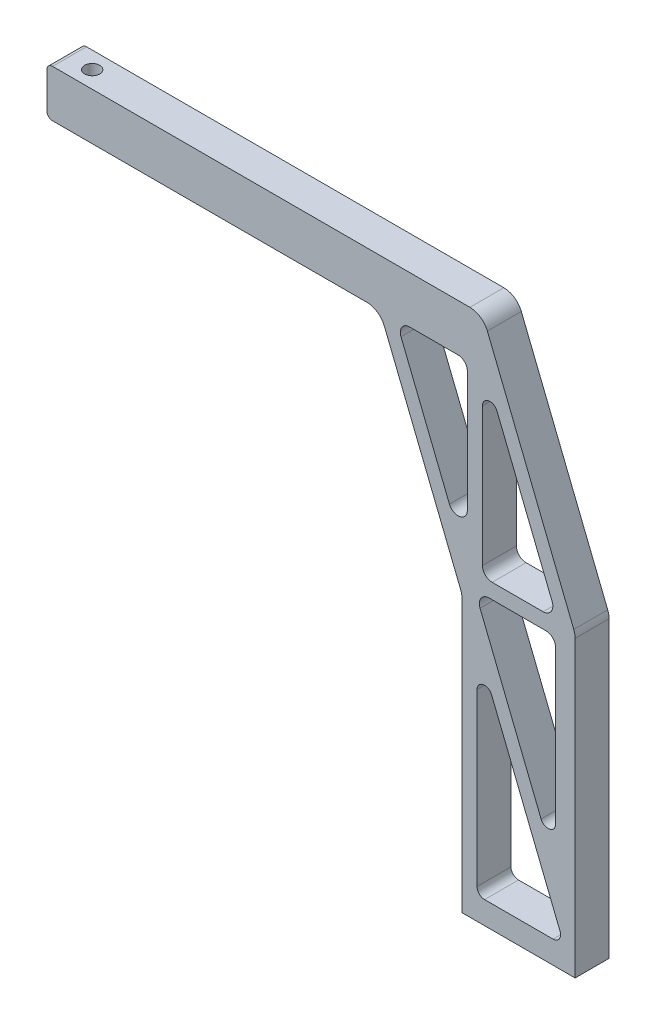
from build123d import *

# Parameters (mm, degrees)
BOSS_EXTRUDE1_DEPTH = 18
CUT_EXTRUDE1_REACH  = 358.545
SKETCH2_R           = 4


with BuildPart() as part:
    # Sketch1 → Boss-Extrude1 (new body)
    with BuildSketch(Plane.XY):
        with BuildLine():
            Line((0, 0), (60, 0))
            Line((60, 0), (60, 155.927840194))
            ThreePointArc((60, 155.927840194), (59.81837561, 157.825075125), (59.280099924, 159.653393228))
            Line((59.280099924, 159.653393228), (13.485131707, 273.725553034))
            ThreePointArc((13.485131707, 273.725553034), (9.806124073, 278.284187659), (4.205031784, 280))
            Line((4.205031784, 280), (-217, 280))
            ThreePointArc((-217, 280), (-219.121320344, 279.121320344), (-220, 277))
            Line((-220, 277), (-220, 258))
            ThreePointArc((-220, 258), (-219.121320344, 255.878679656), (-217, 255))
            Line((-217, 255), (-50.413041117, 255))
            ThreePointArc((-50.413041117, 255), (-44.811948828, 253.284187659), (-41.132941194, 248.725553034))
            Line((-41.132941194, 248.725553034), (-0.719900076, 148.059408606))
            ThreePointArc((-0.719900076, 148.059408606), (-0.18162439, 146.231090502), (0, 144.333855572))
            Line((0, 144.333855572), (0, 100.73642809))
            Line((0, 100.73642809), (0, 0))
        make_face()
        with BuildLine():
            Line((8, 16), (8, 106.390847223))
            ThreePointArc((8, 106.390847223), (11.241106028, 110.318197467), (15.712039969, 107.881068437))
            Line((15.712039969, 107.881068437), (52, 17.490221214))
            ThreePointArc((52, 17.490221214), (51.601635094, 13.759563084), (48.287960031, 12))
            Line((48.287960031, 12), (12, 12))
            ThreePointArc((12, 12), (9.171572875, 13.171572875), (8, 16))
        make_face(mode=Mode.SUBTRACT)
        with BuildLine():
            Line((9.601863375, 144.574425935), (41.951209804, 63.994398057))
            ThreePointArc((41.951209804, 63.994398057), (46.422143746, 61.557269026), (49.663249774, 65.48461927))
            Line((49.663249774, 65.48461927), (49.663249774, 146.495883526))
            ThreePointArc((49.663249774, 146.495883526), (48.152650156, 150.14279361), (44.505740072, 151.653393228))
            Line((44.505740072, 151.653393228), (14.388083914, 151.653393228))
            ThreePointArc((14.388083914, 151.653393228), (10.115506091, 149.384652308), (9.601863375, 144.574425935))
        make_face(mode=Mode.SUBTRACT)
        with BuildLine():
            Line((16.013252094, 159.653393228), (43.031387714, 159.653393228))
            ThreePointArc((43.031387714, 159.653393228), (47.303965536, 161.922134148), (47.817608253, 166.732360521))
            Line((47.817608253, 166.732360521), (18.567782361, 239.591692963))
            ThreePointArc((18.567782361, 239.591692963), (14.09684842, 242.028821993), (10.855742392, 238.101471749))
            Line((10.855742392, 238.101471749), (10.855742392, 164.81090293))
            ThreePointArc((10.855742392, 164.81090293), (12.366342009, 161.163992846), (16.013252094, 159.653393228))
        make_face(mode=Mode.SUBTRACT)
        with BuildLine():
            Line((2.855742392, 186.073407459), (2.855742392, 250.082728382))
            ThreePointArc((2.855742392, 250.082728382), (1.41550688, 253.559764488), (-2.061529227, 255))
            Line((-2.061529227, 255), (-27.758463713, 255))
            ThreePointArc((-27.758463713, 255), (-31.832023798, 252.836937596), (-32.32174091, 248.250772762))
            Line((-32.32174091, 248.250772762), (-6.624806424, 184.241451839))
            ThreePointArc((-6.624806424, 184.241451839), (-1.128607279, 181.245445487), (2.855742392, 186.073407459))
        make_face(mode=Mode.SUBTRACT)
    extrude(amount=BOSS_EXTRUDE1_DEPTH)

    # Sketch2 → Cut-Extrude1 (cut, up to next)
    with BuildSketch(Plane(origin=(0, 280, 0), x_dir=(1, 0, 0), z_dir=(0, 1, 0)), mode=Mode.PRIVATE) as cut_extrude1_sk1:
        with Locations(Location((-205, -9, 0), (0, 0, 180))):
            Circle(SKETCH2_R)
    cut_extrude1_tool1 = extrude(cut_extrude1_sk1.sketch, amount=-CUT_EXTRUDE1_REACH, mode=Mode.PRIVATE) & part.part
    add(cut_extrude1_tool1.solids().sort_by_distance((-205, 280, 9))[0], mode=Mode.SUBTRACT)


solid = part.part
